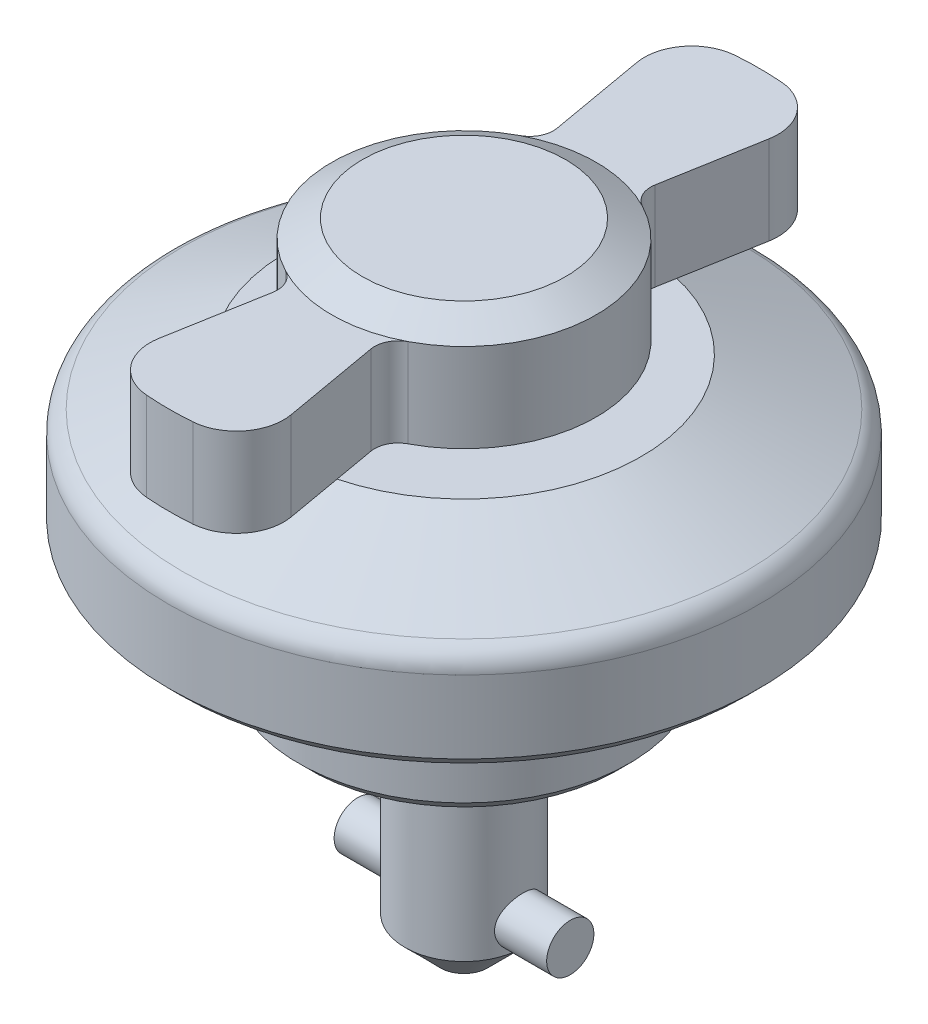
ISO-10303-21;
HEADER;
FILE_DESCRIPTION(('STEP AP214'),'2;1');
FILE_NAME('part.step','',(''),(''),'','','');
FILE_SCHEMA(('AUTOMOTIVE_DESIGN { 1 0 10303 214 1 1 1 1 }'));
ENDSEC;
DATA;
#1=APPLICATION_CONTEXT('core data for automotive mechanical design processes');
#2=APPLICATION_PROTOCOL_DEFINITION('international standard','automotive_design',2000,#1);
#3=PRODUCT_CONTEXT('',#1,'mechanical');
#4=PRODUCT('Part','Part','',(#3));
#5=PRODUCT_RELATED_PRODUCT_CATEGORY('part','',(#4));
#6=PRODUCT_DEFINITION_FORMATION('','',#4);
#7=PRODUCT_DEFINITION_CONTEXT('part definition',#1,'design');
#8=PRODUCT_DEFINITION('design','',#6,#7);
#9=PRODUCT_DEFINITION_SHAPE('','',#8);
#10=(LENGTH_UNIT() NAMED_UNIT(*) SI_UNIT(.MILLI.,.METRE.));
#11=(NAMED_UNIT(*) PLANE_ANGLE_UNIT() SI_UNIT($,.RADIAN.));
#12=(NAMED_UNIT(*) SI_UNIT($,.STERADIAN.) SOLID_ANGLE_UNIT());
#13=UNCERTAINTY_MEASURE_WITH_UNIT(LENGTH_MEASURE(1.E-05),#10,'distance_accuracy_value','');
#14=(GEOMETRIC_REPRESENTATION_CONTEXT(3) GLOBAL_UNCERTAINTY_ASSIGNED_CONTEXT((#13)) GLOBAL_UNIT_ASSIGNED_CONTEXT((#10,
#11,#12)) REPRESENTATION_CONTEXT('',''));
#15=CARTESIAN_POINT('',(0.,0.,0.));
#16=DIRECTION('',(0.,0.,1.));
#17=DIRECTION('',(1.,0.,0.));
#18=AXIS2_PLACEMENT_3D('',#15,#16,#17);
#19=CARTESIAN_POINT('',(0.,12.5,0.));
#20=DIRECTION('',(0.,1.,0.));
#21=DIRECTION('',(0.,0.,1.));
#22=AXIS2_PLACEMENT_3D('',#19,#20,#21);
#23=CYLINDRICAL_SURFACE('',#22,5.6);
#24=CARTESIAN_POINT('',(0.,16.25,0.));
#25=DIRECTION('',(0.,1.,0.));
#26=DIRECTION('',(0.,0.,1.));
#27=AXIS2_PLACEMENT_3D('',#24,#25,#26);
#28=CIRCLE('',#27,5.6);
#29=CARTESIAN_POINT('',(-2.59789595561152,16.25,4.96094110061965));
#30=VERTEX_POINT('',#29);
#31=CARTESIAN_POINT('',(-2.59789595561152,16.25,-4.96094110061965));
#32=VERTEX_POINT('',#31);
#33=EDGE_CURVE('P0_E325',#30,#32,#28,.F.);
#34=ORIENTED_EDGE('',*,*,#33,.T.);
#35=DIRECTION('',(0.,1.,0.));
#36=VECTOR('',#35,1.);
#37=CARTESIAN_POINT('',(-2.59789595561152,12.5,-4.96094110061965));
#38=LINE('',#37,#36);
#39=CARTESIAN_POINT('',(-2.59789595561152,12.5,-4.96094110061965));
#40=VERTEX_POINT('',#39);
#41=EDGE_CURVE('P0_E242',#32,#40,#38,.F.);
#42=ORIENTED_EDGE('',*,*,#41,.T.);
#43=CARTESIAN_POINT('',(0.,12.5,0.));
#44=DIRECTION('',(0.,1.,0.));
#45=DIRECTION('',(0.,0.,1.));
#46=AXIS2_PLACEMENT_3D('',#43,#44,#45);
#47=CIRCLE('',#46,5.6);
#48=CARTESIAN_POINT('',(-2.59789595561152,12.5,4.96094110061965));
#49=VERTEX_POINT('',#48);
#50=EDGE_CURVE('P0_E222',#40,#49,#47,.T.);
#51=ORIENTED_EDGE('',*,*,#50,.T.);
#52=DIRECTION('',(0.,1.,0.));
#53=VECTOR('',#52,1.);
#54=CARTESIAN_POINT('',(-2.59789595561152,12.5,4.96094110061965));
#55=LINE('',#54,#53);
#56=EDGE_CURVE('P0_E234',#49,#30,#55,.T.);
#57=ORIENTED_EDGE('',*,*,#56,.T.);
#58=EDGE_LOOP('',(#34,#42,#51,#57));
#59=FACE_BOUND('',#58,.T.);
#60=ADVANCED_FACE('P0_F16',(#59),#23,.T.);
#61=CARTESIAN_POINT('',(0.,-10.,0.));
#62=DIRECTION('',(0.,-1.,0.));
#63=DIRECTION('',(0.,0.,-1.));
#64=AXIS2_PLACEMENT_3D('',#61,#62,#63);
#65=CYLINDRICAL_SURFACE('',#64,2.);
#66=CARTESIAN_POINT('',(0.,0.,0.));
#67=DIRECTION('',(0.,-1.,0.));
#68=DIRECTION('',(0.,0.,-1.));
#69=AXIS2_PLACEMENT_3D('',#66,#67,#68);
#70=CIRCLE('',#69,2.);
#71=CARTESIAN_POINT('',(0.,0.,-2.));
#72=VERTEX_POINT('',#71);
#73=EDGE_CURVE('P0_E146',#72,#72,#70,.T.);
#74=ORIENTED_EDGE('',*,*,#73,.F.);
#75=EDGE_LOOP('',(#74));
#76=FACE_BOUND('',#75,.T.);
#77=CARTESIAN_POINT('',(0.,12.5,0.));
#78=DIRECTION('',(0.,1.,0.));
#79=DIRECTION('',(0.,0.,1.));
#80=AXIS2_PLACEMENT_3D('',#77,#78,#79);
#81=CIRCLE('',#80,2.);
#82=CARTESIAN_POINT('',(0.,12.5,2.));
#83=VERTEX_POINT('',#82);
#84=EDGE_CURVE('P0_E271',#83,#83,#81,.F.);
#85=ORIENTED_EDGE('',*,*,#84,.T.);
#86=EDGE_LOOP('',(#85));
#87=FACE_BOUND('',#86,.T.);
#88=ADVANCED_FACE('P0_F184',(#76,#87),#65,.T.);
#89=CARTESIAN_POINT('',(0.,-10.,0.));
#90=DIRECTION('',(0.,-1.,0.));
#91=DIRECTION('',(0.,0.,-1.));
#92=AXIS2_PLACEMENT_3D('',#89,#90,#91);
#93=PLANE('',#92);
#94=CARTESIAN_POINT('',(0.,-10.,0.));
#95=DIRECTION('',(0.,-1.,0.));
#96=DIRECTION('',(0.,0.,-1.));
#97=AXIS2_PLACEMENT_3D('',#94,#95,#96);
#98=CIRCLE('',#97,1.);
#99=CARTESIAN_POINT('',(0.,-10.,-1.));
#100=VERTEX_POINT('',#99);
#101=EDGE_CURVE('P0_E137',#100,#100,#98,.T.);
#102=ORIENTED_EDGE('',*,*,#101,.T.);
#103=EDGE_LOOP('',(#102));
#104=FACE_BOUND('',#103,.T.);
#105=ADVANCED_FACE('P0_F186',(#104),#93,.T.);
#106=CARTESIAN_POINT('',(0.,-10.,0.));
#107=DIRECTION('',(0.,1.,0.));
#108=DIRECTION('',(0.,0.,1.));
#109=AXIS2_PLACEMENT_3D('',#106,#107,#108);
#110=CONICAL_SURFACE('',#109,1.,0.78539816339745);
#111=CARTESIAN_POINT('',(0.,-8.50000000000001,0.));
#112=DIRECTION('',(0.,-1.,0.));
#113=DIRECTION('',(0.,0.,-1.));
#114=AXIS2_PLACEMENT_3D('',#111,#112,#113);
#115=CIRCLE('',#114,2.5);
#116=CARTESIAN_POINT('',(2.50000000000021,-8.50000000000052,0.));
#117=VERTEX_POINT('',#116);
#118=CARTESIAN_POINT('',(-2.5,-8.50000000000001,0.));
#119=VERTEX_POINT('',#118);
#120=EDGE_CURVE('P0_E129',#117,#119,#115,.T.);
#121=ORIENTED_EDGE('',*,*,#120,.T.);
#122=EDGE_CURVE('P0_E133',#119,#117,#115,.T.);
#123=ORIENTED_EDGE('',*,*,#122,.T.);
#124=EDGE_LOOP('',(#121,#123));
#125=FACE_BOUND('',#124,.T.);
#126=ORIENTED_EDGE('',*,*,#101,.F.);
#127=EDGE_LOOP('',(#126));
#128=FACE_BOUND('',#127,.T.);
#129=ADVANCED_FACE('P0_F131',(#125,#128),#110,.T.);
#130=CARTESIAN_POINT('',(0.,-10.,0.));
#131=DIRECTION('',(0.,-1.,0.));
#132=DIRECTION('',(0.,0.,-1.));
#133=AXIS2_PLACEMENT_3D('',#130,#131,#132);
#134=CYLINDRICAL_SURFACE('',#133,2.5);
#135=CARTESIAN_POINT('',(0.,0.,0.));
#136=DIRECTION('',(0.,-1.,0.));
#137=DIRECTION('',(0.,0.,-1.));
#138=AXIS2_PLACEMENT_3D('',#135,#136,#137);
#139=CIRCLE('',#138,2.5);
#140=CARTESIAN_POINT('',(0.,0.,-2.5));
#141=VERTEX_POINT('',#140);
#142=EDGE_CURVE('P0_E144',#141,#141,#139,.T.);
#143=ORIENTED_EDGE('',*,*,#142,.T.);
#144=EDGE_LOOP('',(#143));
#145=FACE_BOUND('',#144,.T.);
#146=ORIENTED_EDGE('',*,*,#120,.F.);
#147=CARTESIAN_POINT('',(2.29128784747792,-7.50000000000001,1.));
#148=CARTESIAN_POINT('',(2.29129325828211,-7.55356974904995,0.999994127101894));
#149=CARTESIAN_POINT('',(2.29319301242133,-7.60721526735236,0.995669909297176));
#150=CARTESIAN_POINT('',(2.30055457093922,-7.71296741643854,0.978534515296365));
#151=CARTESIAN_POINT('',(2.30602547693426,-7.76506975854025,0.965701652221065));
#152=CARTESIAN_POINT('',(2.31980227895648,-7.86602647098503,0.932117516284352));
#153=CARTESIAN_POINT('',(2.32809748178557,-7.91489227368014,0.911396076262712));
#154=CARTESIAN_POINT('',(2.3465733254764,-8.00844252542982,0.862710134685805));
#155=CARTESIAN_POINT('',(2.35675355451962,-8.05312788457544,0.83474721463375));
#156=CARTESIAN_POINT('',(2.37850432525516,-8.13963020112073,0.77066098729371));
#157=CARTESIAN_POINT('',(2.39011958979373,-8.18117821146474,0.734189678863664));
#158=CARTESIAN_POINT('',(2.41306228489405,-8.25776449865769,0.654854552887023));
#159=CARTESIAN_POINT('',(2.42438961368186,-8.29280050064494,0.611988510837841));
#160=CARTESIAN_POINT('',(2.44601703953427,-8.35670319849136,0.519003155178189));
#161=CARTESIAN_POINT('',(2.45625901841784,-8.38527215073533,0.468664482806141));
#162=CARTESIAN_POINT('',(2.47401963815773,-8.43342178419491,0.36341266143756));
#163=CARTESIAN_POINT('',(2.48153938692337,-8.45300612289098,0.308501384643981));
#164=CARTESIAN_POINT('',(2.49269162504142,-8.48167074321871,0.198483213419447));
#165=CARTESIAN_POINT('',(2.49649468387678,-8.49121365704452,0.143514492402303));
#166=CARTESIAN_POINT('',(2.50040155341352,-8.50101424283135,0.0326331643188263));
#167=CARTESIAN_POINT('',(2.50050674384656,-8.50127537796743,-0.0232790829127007));
#168=CARTESIAN_POINT('',(2.49710981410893,-8.49275861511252,-0.131116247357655));
#169=CARTESIAN_POINT('',(2.49380998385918,-8.48448761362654,-0.183088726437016));
#170=CARTESIAN_POINT('',(2.48424645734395,-8.46000356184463,-0.284836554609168));
#171=CARTESIAN_POINT('',(2.47798254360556,-8.44378992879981,-0.334611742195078));
#172=CARTESIAN_POINT('',(2.4629841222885,-8.40368175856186,-0.431448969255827));
#173=CARTESIAN_POINT('',(2.454213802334,-8.37967514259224,-0.478458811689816));
#174=CARTESIAN_POINT('',(2.43507292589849,-8.3247674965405,-0.567904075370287));
#175=CARTESIAN_POINT('',(2.42470182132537,-8.2938641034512,-0.610337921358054));
#176=CARTESIAN_POINT('',(2.40260818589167,-8.22367543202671,-0.692384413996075));
#177=CARTESIAN_POINT('',(2.3908416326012,-8.18397305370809,-0.73162892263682));
#178=CARTESIAN_POINT('',(2.36780830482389,-8.09850471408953,-0.803053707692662));
#179=CARTESIAN_POINT('',(2.35654169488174,-8.05273677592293,-0.835231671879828));
#180=CARTESIAN_POINT('',(2.33548448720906,-7.95479048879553,-0.892452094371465));
#181=CARTESIAN_POINT('',(2.3257445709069,-7.9024675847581,-0.917267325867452));
#182=CARTESIAN_POINT('',(2.30943795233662,-7.793892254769,-0.957588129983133));
#183=CARTESIAN_POINT('',(2.3028691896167,-7.73764240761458,-0.973099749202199));
#184=CARTESIAN_POINT('',(2.29414879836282,-7.62648211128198,-0.993477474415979));
#185=CARTESIAN_POINT('',(2.29175183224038,-7.57169977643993,-0.998936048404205));
#186=CARTESIAN_POINT('',(2.29094748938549,-7.46196139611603,-1.00078066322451));
#187=CARTESIAN_POINT('',(2.29253890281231,-7.40700540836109,-0.997169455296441));
#188=CARTESIAN_POINT('',(2.29928022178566,-7.30177053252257,-0.981516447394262));
#189=CARTESIAN_POINT('',(2.30422228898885,-7.25140353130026,-0.969966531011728));
#190=CARTESIAN_POINT('',(2.31685025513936,-7.153355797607,-0.939402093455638));
#191=CARTESIAN_POINT('',(2.32453676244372,-7.10567566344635,-0.920385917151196));
#192=CARTESIAN_POINT('',(2.34216890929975,-7.01219882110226,-0.874567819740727));
#193=CARTESIAN_POINT('',(2.35219352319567,-6.96655690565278,-0.847481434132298));
#194=CARTESIAN_POINT('',(2.37325192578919,-6.88025850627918,-0.786582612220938));
#195=CARTESIAN_POINT('',(2.38428612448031,-6.83960406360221,-0.752767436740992));
#196=CARTESIAN_POINT('',(2.40710457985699,-6.7613132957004,-0.676422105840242));
#197=CARTESIAN_POINT('',(2.41888403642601,-6.72412171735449,-0.63343271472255));
#198=CARTESIAN_POINT('',(2.44109897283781,-6.65741146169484,-0.541541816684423));
#199=CARTESIAN_POINT('',(2.4515343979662,-6.62789309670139,-0.492640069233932));
#200=CARTESIAN_POINT('',(2.46991857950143,-6.57747618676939,-0.390139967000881));
#201=CARTESIAN_POINT('',(2.47786793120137,-6.55657557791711,-0.336542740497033));
#202=CARTESIAN_POINT('',(2.49036356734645,-6.52422557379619,-0.226196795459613));
#203=CARTESIAN_POINT('',(2.49491169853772,-6.51277104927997,-0.169449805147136));
#204=CARTESIAN_POINT('',(2.49989504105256,-6.50024764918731,-0.0584082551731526));
#205=CARTESIAN_POINT('',(2.50057923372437,-6.49854993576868,-0.00419524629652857));
#206=CARTESIAN_POINT('',(2.49843021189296,-6.50392773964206,0.103716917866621));
#207=CARTESIAN_POINT('',(2.49559752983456,-6.51100192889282,0.15741614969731));
#208=CARTESIAN_POINT('',(2.48685756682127,-6.53327339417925,0.261085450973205));
#209=CARTESIAN_POINT('',(2.48104740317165,-6.54821447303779,0.311119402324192));
#210=CARTESIAN_POINT('',(2.46697473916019,-6.58552640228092,0.407961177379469));
#211=CARTESIAN_POINT('',(2.45871178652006,-6.60789862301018,0.454768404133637));
#212=CARTESIAN_POINT('',(2.44009047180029,-6.66055159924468,0.546101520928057));
#213=CARTESIAN_POINT('',(2.42965564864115,-6.69113814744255,0.590435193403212));
#214=CARTESIAN_POINT('',(2.40794701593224,-6.75889425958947,0.673527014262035));
#215=CARTESIAN_POINT('',(2.3966728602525,-6.79606654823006,0.712282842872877));
#216=CARTESIAN_POINT('',(2.37368881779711,-6.87865761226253,0.785600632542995));
#217=CARTESIAN_POINT('',(2.36199516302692,-6.92444443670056,0.819754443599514));
#218=CARTESIAN_POINT('',(2.3402483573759,-7.02147106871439,0.879923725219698));
#219=CARTESIAN_POINT('',(2.33019539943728,-7.07271151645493,0.905938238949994));
#220=CARTESIAN_POINT('',(2.31379432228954,-7.17451860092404,0.946995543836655));
#221=CARTESIAN_POINT('',(2.30719459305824,-7.22473261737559,0.962813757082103));
#222=CARTESIAN_POINT('',(2.29723001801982,-7.32724270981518,0.986358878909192));
#223=CARTESIAN_POINT('',(2.29385616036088,-7.37953255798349,0.994108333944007));
#224=CARTESIAN_POINT('',(2.29162229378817,-7.45468878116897,0.999232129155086));
#225=CARTESIAN_POINT('',(2.29128555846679,-7.47733761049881,1.00000248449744));
#226=CARTESIAN_POINT('',(2.29128784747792,-7.50000000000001,1.));
#227=B_SPLINE_CURVE_WITH_KNOTS('',3,(#147,#148,#149,#150,#151,#152,#153,#154,#155,#156,#157,
#158,#159,#160,#161,#162,#163,#164,#165,#166,#167,#168,#169,#170,#171,#172,#173,#174,#175,#176,
#177,#178,#179,#180,#181,#182,#183,#184,#185,#186,#187,#188,#189,#190,#191,#192,#193,#194,#195,
#196,#197,#198,#199,#200,#201,#202,#203,#204,#205,#206,#207,#208,#209,#210,#211,#212,#213,#214,
#215,#216,#217,#218,#219,#220,#221,#222,#223,#224,#225,#226),.UNSPECIFIED.,.T.,.F.,(4,2,2,2,2,2,
2,2,2,2,2,2,2,2,2,2,2,2,2,2,2,2,2,2,2,2,2,2,2,2,2,2,2,2,2,2,2,2,2,4),(0.,0.160638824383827,
0.321688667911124,0.482135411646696,0.642547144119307,0.811278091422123,0.980067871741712,
1.15551334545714,1.3308873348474,1.49777091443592,1.66459222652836,1.82204322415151,
1.9795057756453,2.13934150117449,2.29923207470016,2.46962022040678,2.64006403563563,
2.81532229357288,2.99046652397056,3.15491073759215,3.31930507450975,3.47433624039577,
3.62940179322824,3.79075577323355,3.95217557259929,4.12551867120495,4.29886882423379,
4.47217743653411,4.64539187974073,4.80730519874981,4.96919400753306,5.12610997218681,
5.28305488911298,5.44693525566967,5.61088358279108,5.78498126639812,5.95909940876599,
6.11758330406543,6.27562315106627,6.34358052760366),.UNSPECIFIED.);
#228=EDGE_CURVE('P0_E143',#117,#117,#227,.T.);
#229=ORIENTED_EDGE('',*,*,#228,.F.);
#230=ORIENTED_EDGE('',*,*,#122,.F.);
#231=CARTESIAN_POINT('',(-2.29128784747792,-7.50000000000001,1.));
#232=CARTESIAN_POINT('',(-2.29129325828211,-7.44643025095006,0.999994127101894));
#233=CARTESIAN_POINT('',(-2.29319301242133,-7.39278473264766,0.995669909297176));
#234=CARTESIAN_POINT('',(-2.30055457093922,-7.28703258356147,0.978534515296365));
#235=CARTESIAN_POINT('',(-2.30602547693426,-7.23493024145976,0.965701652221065));
#236=CARTESIAN_POINT('',(-2.31980227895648,-7.13397352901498,0.932117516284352));
#237=CARTESIAN_POINT('',(-2.32809748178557,-7.08510772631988,0.911396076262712));
#238=CARTESIAN_POINT('',(-2.3465733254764,-6.9915574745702,0.862710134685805));
#239=CARTESIAN_POINT('',(-2.35675355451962,-6.94687211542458,0.83474721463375));
#240=CARTESIAN_POINT('',(-2.37850432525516,-6.86036979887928,0.77066098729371));
#241=CARTESIAN_POINT('',(-2.39011958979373,-6.81882178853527,0.734189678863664));
#242=CARTESIAN_POINT('',(-2.41306228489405,-6.74223550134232,0.654854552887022));
#243=CARTESIAN_POINT('',(-2.42438961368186,-6.70719949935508,0.61198851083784));
#244=CARTESIAN_POINT('',(-2.44601703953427,-6.64329680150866,0.519003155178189));
#245=CARTESIAN_POINT('',(-2.45625901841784,-6.61472784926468,0.468664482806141));
#246=CARTESIAN_POINT('',(-2.47401963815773,-6.5665782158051,0.36341266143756));
#247=CARTESIAN_POINT('',(-2.48153938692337,-6.54699387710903,0.308501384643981));
#248=CARTESIAN_POINT('',(-2.49269162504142,-6.51832925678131,0.198483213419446));
#249=CARTESIAN_POINT('',(-2.49649468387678,-6.5087863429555,0.143514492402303));
#250=CARTESIAN_POINT('',(-2.50040155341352,-6.49898575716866,0.0326331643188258));
#251=CARTESIAN_POINT('',(-2.50050674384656,-6.49872462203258,-0.0232790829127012));
#252=CARTESIAN_POINT('',(-2.49710981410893,-6.5072413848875,-0.131116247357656));
#253=CARTESIAN_POINT('',(-2.49380998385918,-6.51551238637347,-0.183088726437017));
#254=CARTESIAN_POINT('',(-2.48424645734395,-6.53999643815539,-0.284836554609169));
#255=CARTESIAN_POINT('',(-2.47798254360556,-6.5562100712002,-0.334611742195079));
#256=CARTESIAN_POINT('',(-2.4629841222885,-6.59631824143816,-0.431448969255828));
#257=CARTESIAN_POINT('',(-2.454213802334,-6.62032485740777,-0.478458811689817));
#258=CARTESIAN_POINT('',(-2.43507292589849,-6.67523250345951,-0.567904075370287));
#259=CARTESIAN_POINT('',(-2.42470182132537,-6.70613589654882,-0.610337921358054));
#260=CARTESIAN_POINT('',(-2.40260818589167,-6.7763245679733,-0.692384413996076));
#261=CARTESIAN_POINT('',(-2.3908416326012,-6.81602694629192,-0.731628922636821));
#262=CARTESIAN_POINT('',(-2.36780830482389,-6.90149528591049,-0.803053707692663));
#263=CARTESIAN_POINT('',(-2.35654169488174,-6.94726322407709,-0.835231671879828));
#264=CARTESIAN_POINT('',(-2.33548448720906,-7.04520951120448,-0.892452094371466));
#265=CARTESIAN_POINT('',(-2.3257445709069,-7.09753241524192,-0.917267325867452));
#266=CARTESIAN_POINT('',(-2.30943795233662,-7.20610774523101,-0.957588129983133));
#267=CARTESIAN_POINT('',(-2.3028691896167,-7.26235759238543,-0.973099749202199));
#268=CARTESIAN_POINT('',(-2.29414879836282,-7.37351788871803,-0.993477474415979));
#269=CARTESIAN_POINT('',(-2.29175183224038,-7.42830022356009,-0.998936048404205));
#270=CARTESIAN_POINT('',(-2.29094748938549,-7.53803860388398,-1.00078066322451));
#271=CARTESIAN_POINT('',(-2.29253890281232,-7.59299459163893,-0.997169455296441));
#272=CARTESIAN_POINT('',(-2.29928022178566,-7.69822946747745,-0.981516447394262));
#273=CARTESIAN_POINT('',(-2.30422228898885,-7.74859646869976,-0.969966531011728));
#274=CARTESIAN_POINT('',(-2.31685025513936,-7.84664420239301,-0.939402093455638));
#275=CARTESIAN_POINT('',(-2.32453676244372,-7.89432433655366,-0.920385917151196));
#276=CARTESIAN_POINT('',(-2.34216890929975,-7.98780117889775,-0.874567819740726));
#277=CARTESIAN_POINT('',(-2.35219352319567,-8.03344309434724,-0.847481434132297));
#278=CARTESIAN_POINT('',(-2.37325192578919,-8.11974149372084,-0.786582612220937));
#279=CARTESIAN_POINT('',(-2.38428612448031,-8.1603959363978,-0.752767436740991));
#280=CARTESIAN_POINT('',(-2.40710457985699,-8.23868670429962,-0.676422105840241));
#281=CARTESIAN_POINT('',(-2.41888403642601,-8.27587828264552,-0.633432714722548));
#282=CARTESIAN_POINT('',(-2.44109897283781,-8.34258853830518,-0.54154181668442));
#283=CARTESIAN_POINT('',(-2.4515343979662,-8.37210690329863,-0.492640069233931));
#284=CARTESIAN_POINT('',(-2.46991857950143,-8.42252381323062,-0.39013996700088));
#285=CARTESIAN_POINT('',(-2.47786793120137,-8.4434244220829,-0.336542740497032));
#286=CARTESIAN_POINT('',(-2.49036356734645,-8.47577442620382,-0.226196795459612));
#287=CARTESIAN_POINT('',(-2.49491169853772,-8.48722895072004,-0.169449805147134));
#288=CARTESIAN_POINT('',(-2.49989504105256,-8.4997523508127,-0.0584082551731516));
#289=CARTESIAN_POINT('',(-2.50057923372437,-8.50145006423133,-0.00419524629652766));
#290=CARTESIAN_POINT('',(-2.49843021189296,-8.49607226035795,0.103716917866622));
#291=CARTESIAN_POINT('',(-2.49559752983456,-8.4889980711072,0.157416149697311));
#292=CARTESIAN_POINT('',(-2.48685756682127,-8.46672660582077,0.261085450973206));
#293=CARTESIAN_POINT('',(-2.48104740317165,-8.45178552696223,0.311119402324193));
#294=CARTESIAN_POINT('',(-2.46697473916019,-8.41447359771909,0.40796117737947));
#295=CARTESIAN_POINT('',(-2.45871178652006,-8.39210137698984,0.454768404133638));
#296=CARTESIAN_POINT('',(-2.44009047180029,-8.33944840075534,0.546101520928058));
#297=CARTESIAN_POINT('',(-2.42965564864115,-8.30886185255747,0.590435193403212));
#298=CARTESIAN_POINT('',(-2.40794701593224,-8.24110574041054,0.673527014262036));
#299=CARTESIAN_POINT('',(-2.3966728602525,-8.20393345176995,0.712282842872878));
#300=CARTESIAN_POINT('',(-2.37368881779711,-8.12134238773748,0.785600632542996));
#301=CARTESIAN_POINT('',(-2.36199516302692,-8.07555556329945,0.819754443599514));
#302=CARTESIAN_POINT('',(-2.3402483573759,-7.97852893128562,0.879923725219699));
#303=CARTESIAN_POINT('',(-2.33019539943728,-7.92728848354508,0.905938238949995));
#304=CARTESIAN_POINT('',(-2.31379432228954,-7.82548139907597,0.946995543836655));
#305=CARTESIAN_POINT('',(-2.30719459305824,-7.77526738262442,0.962813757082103));
#306=CARTESIAN_POINT('',(-2.29723001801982,-7.67275729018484,0.986358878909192));
#307=CARTESIAN_POINT('',(-2.29385616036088,-7.62046744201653,0.994108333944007));
#308=CARTESIAN_POINT('',(-2.29162229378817,-7.54531121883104,0.999232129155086));
#309=CARTESIAN_POINT('',(-2.29128555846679,-7.52266238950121,1.00000248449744));
#310=CARTESIAN_POINT('',(-2.29128784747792,-7.50000000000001,1.));
#311=B_SPLINE_CURVE_WITH_KNOTS('',3,(#231,#232,#233,#234,#235,#236,#237,#238,#239,#240,#241,
#242,#243,#244,#245,#246,#247,#248,#249,#250,#251,#252,#253,#254,#255,#256,#257,#258,#259,#260,
#261,#262,#263,#264,#265,#266,#267,#268,#269,#270,#271,#272,#273,#274,#275,#276,#277,#278,#279,
#280,#281,#282,#283,#284,#285,#286,#287,#288,#289,#290,#291,#292,#293,#294,#295,#296,#297,#298,
#299,#300,#301,#302,#303,#304,#305,#306,#307,#308,#309,#310),.UNSPECIFIED.,.T.,.F.,(4,2,2,2,2,2,
2,2,2,2,2,2,2,2,2,2,2,2,2,2,2,2,2,2,2,2,2,2,2,2,2,2,2,2,2,2,2,2,2,4),(0.,0.160638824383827,
0.321688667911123,0.482135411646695,0.642547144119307,0.811278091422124,0.980067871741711,
1.15551334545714,1.3308873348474,1.49777091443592,1.66459222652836,1.82204322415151,
1.9795057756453,2.13934150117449,2.29923207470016,2.46962022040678,2.64006403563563,
2.81532229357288,2.99046652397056,3.15491073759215,3.31930507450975,3.47433624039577,
3.62940179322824,3.79075577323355,3.9521755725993,4.12551867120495,4.29886882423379,
4.47217743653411,4.64539187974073,4.80730519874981,4.96919400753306,5.12610997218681,
5.28305488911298,5.44693525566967,5.61088358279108,5.78498126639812,5.95909940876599,
6.11758330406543,6.27562315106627,6.34358052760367),.UNSPECIFIED.);
#312=EDGE_CURVE('P0_E141',#119,#119,#311,.T.);
#313=ORIENTED_EDGE('',*,*,#312,.F.);
#314=EDGE_LOOP('',(#146,#229,#230,#313));
#315=FACE_BOUND('',#314,.T.);
#316=ADVANCED_FACE('P0_F139',(#145,#315),#134,.T.);
#317=CARTESIAN_POINT('',(2.5,0.,0.));
#318=DIRECTION('',(0.,1.,0.));
#319=DIRECTION('',(0.,0.,1.));
#320=AXIS2_PLACEMENT_3D('',#317,#318,#319);
#321=PLANE('',#320);
#322=ORIENTED_EDGE('',*,*,#73,.T.);
#323=EDGE_LOOP('',(#322));
#324=FACE_BOUND('',#323,.T.);
#325=ORIENTED_EDGE('',*,*,#142,.F.);
#326=EDGE_LOOP('',(#325));
#327=FACE_BOUND('',#326,.T.);
#328=ADVANCED_FACE('P0_F176',(#324,#327),#321,.T.);
#329=CARTESIAN_POINT('',(-4.5,-7.50000000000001,0.));
#330=DIRECTION('',(-1.,0.,0.));
#331=DIRECTION('',(0.,0.,1.));
#332=AXIS2_PLACEMENT_3D('',#329,#330,#331);
#333=PLANE('',#332);
#334=CARTESIAN_POINT('',(-4.5,-7.50000000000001,0.));
#335=DIRECTION('',(-1.,0.,0.));
#336=DIRECTION('',(0.,0.,1.));
#337=AXIS2_PLACEMENT_3D('',#334,#335,#336);
#338=CIRCLE('',#337,1.);
#339=CARTESIAN_POINT('',(-4.5,-7.50000000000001,1.));
#340=VERTEX_POINT('',#339);
#341=EDGE_CURVE('P0_E315',#340,#340,#338,.T.);
#342=ORIENTED_EDGE('',*,*,#341,.T.);
#343=EDGE_LOOP('',(#342));
#344=FACE_BOUND('',#343,.T.);
#345=ADVANCED_FACE('P0_F169',(#344),#333,.T.);
#346=CARTESIAN_POINT('',(-5.26029262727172,-7.50000000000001,0.));
#347=DIRECTION('',(-1.,0.,0.));
#348=DIRECTION('',(0.,0.,1.));
#349=AXIS2_PLACEMENT_3D('',#346,#347,#348);
#350=CYLINDRICAL_SURFACE('',#349,1.);
#351=ORIENTED_EDGE('',*,*,#312,.T.);
#352=EDGE_LOOP('',(#351));
#353=FACE_BOUND('',#352,.T.);
#354=ORIENTED_EDGE('',*,*,#341,.F.);
#355=EDGE_LOOP('',(#354));
#356=FACE_BOUND('',#355,.T.);
#357=ADVANCED_FACE('P0_F163',(#353,#356),#350,.T.);
#358=ORIENTED_EDGE('',*,*,#228,.T.);
#359=EDGE_LOOP('',(#358));
#360=FACE_BOUND('',#359,.T.);
#361=CARTESIAN_POINT('',(4.5,-7.50000000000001,0.));
#362=DIRECTION('',(-1.,0.,0.));
#363=DIRECTION('',(0.,0.,1.));
#364=AXIS2_PLACEMENT_3D('',#361,#362,#363);
#365=CIRCLE('',#364,1.);
#366=CARTESIAN_POINT('',(4.5,-7.50000000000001,1.));
#367=VERTEX_POINT('',#366);
#368=EDGE_CURVE('P0_E312',#367,#367,#365,.T.);
#369=ORIENTED_EDGE('',*,*,#368,.T.);
#370=EDGE_LOOP('',(#369));
#371=FACE_BOUND('',#370,.T.);
#372=ADVANCED_FACE('P0_F168',(#360,#371),#350,.T.);
#373=CARTESIAN_POINT('',(4.5,-8.50000000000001,0.));
#374=DIRECTION('',(1.,0.,0.));
#375=DIRECTION('',(0.,0.,-1.));
#376=AXIS2_PLACEMENT_3D('',#373,#374,#375);
#377=PLANE('',#376);
#378=ORIENTED_EDGE('',*,*,#368,.F.);
#379=EDGE_LOOP('',(#378));
#380=FACE_BOUND('',#379,.T.);
#381=ADVANCED_FACE('P0_F171',(#380),#377,.T.);
#382=CARTESIAN_POINT('',(2.59789595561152,12.5,4.96094110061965));
#383=VERTEX_POINT('',#382);
#384=CARTESIAN_POINT('',(2.59789595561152,12.5,-4.96094110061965));
#385=VERTEX_POINT('',#384);
#386=EDGE_CURVE('P0_E215',#383,#385,#47,.T.);
#387=ORIENTED_EDGE('',*,*,#386,.T.);
#388=DIRECTION('',(0.,1.,0.));
#389=VECTOR('',#388,1.);
#390=CARTESIAN_POINT('',(2.59789595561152,12.5,-4.96094110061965));
#391=LINE('',#390,#389);
#392=CARTESIAN_POINT('',(2.59789595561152,16.25,-4.96094110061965));
#393=VERTEX_POINT('',#392);
#394=EDGE_CURVE('P0_E218',#385,#393,#391,.T.);
#395=ORIENTED_EDGE('',*,*,#394,.T.);
#396=CARTESIAN_POINT('',(2.59789595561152,16.25,4.96094110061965));
#397=VERTEX_POINT('',#396);
#398=EDGE_CURVE('P0_E328',#393,#397,#28,.F.);
#399=ORIENTED_EDGE('',*,*,#398,.T.);
#400=DIRECTION('',(0.,1.,0.));
#401=VECTOR('',#400,1.);
#402=CARTESIAN_POINT('',(2.59789595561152,12.5,4.96094110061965));
#403=LINE('',#402,#401);
#404=EDGE_CURVE('P0_E220',#397,#383,#403,.F.);
#405=ORIENTED_EDGE('',*,*,#404,.T.);
#406=EDGE_LOOP('',(#387,#395,#399,#405));
#407=FACE_BOUND('',#406,.T.);
#408=ADVANCED_FACE('P0_F199',(#407),#23,.T.);
#409=CARTESIAN_POINT('',(0.,12.5,0.));
#410=DIRECTION('',(0.,1.,0.));
#411=DIRECTION('',(0.,0.,1.));
#412=AXIS2_PLACEMENT_3D('',#409,#410,#411);
#413=PLANE('',#412);
#414=ORIENTED_EDGE('',*,*,#84,.F.);
#415=EDGE_LOOP('',(#414));
#416=FACE_BOUND('',#415,.T.);
#417=CARTESIAN_POINT('',(0.,12.5,0.));
#418=DIRECTION('',(0.,-1.,0.));
#419=DIRECTION('',(0.,0.,-1.));
#420=AXIS2_PLACEMENT_3D('',#417,#418,#419);
#421=CIRCLE('',#420,12.5);
#422=CARTESIAN_POINT('',(-0.988345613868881,12.5,-12.460865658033));
#423=VERTEX_POINT('',#422);
#424=CARTESIAN_POINT('',(0.988345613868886,12.5,-12.460865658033));
#425=VERTEX_POINT('',#424);
#426=EDGE_CURVE('P0_E309',#423,#425,#421,.T.);
#427=ORIENTED_EDGE('',*,*,#426,.T.);
#428=CARTESIAN_POINT('',(0.830210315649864,12.5,-10.4671271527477));
#429=DIRECTION('',(0.,1.,0.));
#430=DIRECTION('',(0.,0.,1.));
#431=AXIS2_PLACEMENT_3D('',#428,#429,#430);
#432=CIRCLE('',#431,2.);
#433=CARTESIAN_POINT('',(2.79982582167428,12.5,-10.1198307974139));
#434=VERTEX_POINT('',#433);
#435=EDGE_CURVE('P0_E339',#425,#434,#432,.F.);
#436=ORIENTED_EDGE('',*,*,#435,.T.);
#437=DIRECTION('',(0.173648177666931,0.,-0.984807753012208));
#438=VECTOR('',#437,1.);
#439=CARTESIAN_POINT('',(4.65281599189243,12.5,-20.6286602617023));
#440=LINE('',#439,#438);
#441=CARTESIAN_POINT('',(2.07699819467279,12.5,-6.02047161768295));
#442=VERTEX_POINT('',#441);
#443=EDGE_CURVE('P0_E304',#442,#434,#440,.T.);
#444=ORIENTED_EDGE('',*,*,#443,.F.);
#445=CARTESIAN_POINT('',(3.061805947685,12.5,-5.84682344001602));
#446=DIRECTION('',(0.,1.,0.));
#447=DIRECTION('',(0.,0.,1.));
#448=AXIS2_PLACEMENT_3D('',#445,#446,#447);
#449=CIRCLE('',#448,1.);
#450=EDGE_CURVE('P0_E229',#442,#385,#449,.T.);
#451=ORIENTED_EDGE('',*,*,#450,.T.);
#452=ORIENTED_EDGE('',*,*,#386,.F.);
#453=CARTESIAN_POINT('',(3.061805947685,12.5,5.84682344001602));
#454=DIRECTION('',(0.,1.,0.));
#455=DIRECTION('',(0.,0.,1.));
#456=AXIS2_PLACEMENT_3D('',#453,#454,#455);
#457=CIRCLE('',#456,1.);
#458=CARTESIAN_POINT('',(2.0769981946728,12.5,6.02047161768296));
#459=VERTEX_POINT('',#458);
#460=EDGE_CURVE('P0_E252',#383,#459,#457,.T.);
#461=ORIENTED_EDGE('',*,*,#460,.T.);
#462=DIRECTION('',(0.173648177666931,0.,0.984807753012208));
#463=VECTOR('',#462,1.);
#464=CARTESIAN_POINT('',(-2.68320048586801,12.5,-20.9759566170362));
#465=LINE('',#464,#463);
#466=CARTESIAN_POINT('',(2.79982582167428,12.5,10.1198307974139));
#467=VERTEX_POINT('',#466);
#468=EDGE_CURVE('P0_E295',#459,#467,#465,.T.);
#469=ORIENTED_EDGE('',*,*,#468,.T.);
#470=CARTESIAN_POINT('',(0.830210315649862,12.5,10.4671271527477));
#471=DIRECTION('',(0.,1.,0.));
#472=DIRECTION('',(0.,0.,1.));
#473=AXIS2_PLACEMENT_3D('',#470,#471,#472);
#474=CIRCLE('',#473,2.);
#475=CARTESIAN_POINT('',(0.988345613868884,12.5,12.460865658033));
#476=VERTEX_POINT('',#475);
#477=EDGE_CURVE('P0_E337',#467,#476,#474,.F.);
#478=ORIENTED_EDGE('',*,*,#477,.T.);
#479=CARTESIAN_POINT('',(0.,12.5,0.));
#480=DIRECTION('',(0.,-1.,0.));
#481=DIRECTION('',(0.,0.,-1.));
#482=AXIS2_PLACEMENT_3D('',#479,#480,#481);
#483=CIRCLE('',#482,12.5);
#484=CARTESIAN_POINT('',(-0.988345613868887,12.5,12.460865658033));
#485=VERTEX_POINT('',#484);
#486=EDGE_CURVE('P0_E297',#476,#485,#483,.T.);
#487=ORIENTED_EDGE('',*,*,#486,.T.);
#488=CARTESIAN_POINT('',(-0.830210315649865,12.5,10.4671271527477));
#489=DIRECTION('',(0.,1.,0.));
#490=DIRECTION('',(0.,0.,1.));
#491=AXIS2_PLACEMENT_3D('',#488,#489,#490);
#492=CIRCLE('',#491,2.);
#493=CARTESIAN_POINT('',(-2.79982582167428,12.5,10.1198307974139));
#494=VERTEX_POINT('',#493);
#495=EDGE_CURVE('P0_E335',#485,#494,#492,.F.);
#496=ORIENTED_EDGE('',*,*,#495,.T.);
#497=DIRECTION('',(-0.173648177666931,0.,0.984807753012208));
#498=VECTOR('',#497,1.);
#499=CARTESIAN_POINT('',(2.68320048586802,12.5,-20.9759566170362));
#500=LINE('',#499,#498);
#501=CARTESIAN_POINT('',(-2.0769981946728,12.5,6.02047161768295));
#502=VERTEX_POINT('',#501);
#503=EDGE_CURVE('P0_E266',#502,#494,#500,.T.);
#504=ORIENTED_EDGE('',*,*,#503,.F.);
#505=CARTESIAN_POINT('',(-3.061805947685,12.5,5.84682344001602));
#506=DIRECTION('',(0.,1.,0.));
#507=DIRECTION('',(0.,0.,1.));
#508=AXIS2_PLACEMENT_3D('',#505,#506,#507);
#509=CIRCLE('',#508,1.);
#510=EDGE_CURVE('P0_E25',#502,#49,#509,.T.);
#511=ORIENTED_EDGE('',*,*,#510,.T.);
#512=ORIENTED_EDGE('',*,*,#50,.F.);
#513=CARTESIAN_POINT('',(-3.061805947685,12.5,-5.84682344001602));
#514=DIRECTION('',(0.,1.,0.));
#515=DIRECTION('',(0.,0.,1.));
#516=AXIS2_PLACEMENT_3D('',#513,#514,#515);
#517=CIRCLE('',#516,1.);
#518=CARTESIAN_POINT('',(-2.07699819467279,12.5,-6.02047161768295));
#519=VERTEX_POINT('',#518);
#520=EDGE_CURVE('P0_E257',#40,#519,#517,.T.);
#521=ORIENTED_EDGE('',*,*,#520,.T.);
#522=DIRECTION('',(-0.173648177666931,0.,-0.984807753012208));
#523=VECTOR('',#522,1.);
#524=CARTESIAN_POINT('',(-4.65281599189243,12.5,-20.6286602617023));
#525=LINE('',#524,#523);
#526=CARTESIAN_POINT('',(-2.79982582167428,12.5,-10.1198307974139));
#527=VERTEX_POINT('',#526);
#528=EDGE_CURVE('P0_E288',#519,#527,#525,.T.);
#529=ORIENTED_EDGE('',*,*,#528,.T.);
#530=CARTESIAN_POINT('',(-0.83021031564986,12.5,-10.4671271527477));
#531=DIRECTION('',(0.,1.,0.));
#532=DIRECTION('',(0.,0.,1.));
#533=AXIS2_PLACEMENT_3D('',#530,#531,#532);
#534=CIRCLE('',#533,2.);
#535=EDGE_CURVE('P0_E333',#527,#423,#534,.F.);
#536=ORIENTED_EDGE('',*,*,#535,.T.);
#537=EDGE_LOOP('',(#427,#436,#444,#451,#452,#461,#469,#478,#487,#496,#504,#511,#512,#521,#529,#536));
#538=FACE_BOUND('',#537,.T.);
#539=ADVANCED_FACE('P0_F182',(#416,#538),#413,.F.);
#540=CARTESIAN_POINT('',(1.5,17.,0.));
#541=DIRECTION('',(0.,1.,0.));
#542=DIRECTION('',(0.,0.,1.));
#543=AXIS2_PLACEMENT_3D('',#540,#541,#542);
#544=PLANE('',#543);
#545=CARTESIAN_POINT('',(0.,17.,0.));
#546=DIRECTION('',(0.,1.,0.));
#547=DIRECTION('',(0.,0.,1.));
#548=AXIS2_PLACEMENT_3D('',#545,#546,#547);
#549=CIRCLE('',#548,4.30096189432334);
#550=CARTESIAN_POINT('',(0.,17.,4.30096189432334));
#551=VERTEX_POINT('',#550);
#552=EDGE_CURVE('P0_E322',#551,#551,#549,.T.);
#553=ORIENTED_EDGE('',*,*,#552,.T.);
#554=EDGE_LOOP('',(#553));
#555=FACE_BOUND('',#554,.T.);
#556=ADVANCED_FACE('P0_F178',(#555),#544,.T.);
#557=CARTESIAN_POINT('',(0.,17.,0.));
#558=DIRECTION('',(0.,-1.,0.));
#559=DIRECTION('',(0.,0.,-1.));
#560=AXIS2_PLACEMENT_3D('',#557,#558,#559);
#561=CONICAL_SURFACE('',#560,4.30096189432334,1.0471975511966);
#562=EDGE_CURVE('P0_E32',#32,#393,#28,.F.);
#563=ORIENTED_EDGE('',*,*,#562,.F.);
#564=ORIENTED_EDGE('',*,*,#33,.F.);
#565=CARTESIAN_POINT('',(0.,16.25,0.));
#566=DIRECTION('',(0.,-1.,0.));
#567=DIRECTION('',(0.,0.,-1.));
#568=AXIS2_PLACEMENT_3D('',#565,#566,#567);
#569=CIRCLE('',#568,5.6);
#570=EDGE_CURVE('P0_E280',#397,#30,#569,.T.);
#571=ORIENTED_EDGE('',*,*,#570,.F.);
#572=ORIENTED_EDGE('',*,*,#398,.F.);
#573=EDGE_LOOP('',(#563,#564,#571,#572));
#574=FACE_BOUND('',#573,.T.);
#575=ORIENTED_EDGE('',*,*,#552,.F.);
#576=EDGE_LOOP('',(#575));
#577=FACE_BOUND('',#576,.T.);
#578=ADVANCED_FACE('P0_F181',(#574,#577),#561,.T.);
#579=CARTESIAN_POINT('',(-4.65281599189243,16.25,-20.6286602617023));
#580=DIRECTION('',(-0.984807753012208,0.,0.173648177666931));
#581=DIRECTION('',(0.173648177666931,0.,0.984807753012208));
#582=AXIS2_PLACEMENT_3D('',#579,#580,#581);
#583=PLANE('',#582);
#584=ORIENTED_EDGE('',*,*,#528,.F.);
#585=DIRECTION('',(0.,-1.,0.));
#586=VECTOR('',#585,1.);
#587=CARTESIAN_POINT('',(-2.07699819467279,16.25,-6.02047161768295));
#588=LINE('',#587,#586);
#589=CARTESIAN_POINT('',(-2.07699819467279,16.25,-6.02047161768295));
#590=VERTEX_POINT('',#589);
#591=EDGE_CURVE('P0_E245',#519,#590,#588,.F.);
#592=ORIENTED_EDGE('',*,*,#591,.T.);
#593=DIRECTION('',(-0.173648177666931,0.,-0.984807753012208));
#594=VECTOR('',#593,1.);
#595=CARTESIAN_POINT('',(-4.65281599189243,16.25,-20.6286602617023));
#596=LINE('',#595,#594);
#597=CARTESIAN_POINT('',(-2.79982582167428,16.25,-10.1198307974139));
#598=VERTEX_POINT('',#597);
#599=EDGE_CURVE('P0_E301',#590,#598,#596,.T.);
#600=ORIENTED_EDGE('',*,*,#599,.T.);
#601=DIRECTION('',(0.,-1.,0.));
#602=VECTOR('',#601,1.);
#603=CARTESIAN_POINT('',(-2.79982582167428,16.25,-10.1198307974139));
#604=LINE('',#603,#602);
#605=EDGE_CURVE('P0_E364',#598,#527,#604,.T.);
#606=ORIENTED_EDGE('',*,*,#605,.T.);
#607=EDGE_LOOP('',(#584,#592,#600,#606));
#608=FACE_BOUND('',#607,.T.);
#609=ADVANCED_FACE('P0_F394',(#608),#583,.T.);
#610=CARTESIAN_POINT('',(4.65281599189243,16.25,-20.6286602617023));
#611=DIRECTION('',(-0.984807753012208,0.,-0.173648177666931));
#612=DIRECTION('',(-0.173648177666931,0.,0.984807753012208));
#613=AXIS2_PLACEMENT_3D('',#610,#611,#612);
#614=PLANE('',#613);
#615=DIRECTION('',(0.173648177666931,0.,-0.984807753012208));
#616=VECTOR('',#615,1.);
#617=CARTESIAN_POINT('',(4.65281599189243,16.25,-20.6286602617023));
#618=LINE('',#617,#616);
#619=CARTESIAN_POINT('',(2.07699819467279,16.25,-6.02047161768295));
#620=VERTEX_POINT('',#619);
#621=CARTESIAN_POINT('',(2.79982582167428,16.25,-10.1198307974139));
#622=VERTEX_POINT('',#621);
#623=EDGE_CURVE('P0_E223',#620,#622,#618,.T.);
#624=ORIENTED_EDGE('',*,*,#623,.F.);
#625=DIRECTION('',(0.,1.,0.));
#626=VECTOR('',#625,1.);
#627=CARTESIAN_POINT('',(2.0769981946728,16.25,-6.02047161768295));
#628=LINE('',#627,#626);
#629=EDGE_CURVE('P0_E236',#620,#442,#628,.F.);
#630=ORIENTED_EDGE('',*,*,#629,.T.);
#631=ORIENTED_EDGE('',*,*,#443,.T.);
#632=DIRECTION('',(0.,1.,0.));
#633=VECTOR('',#632,1.);
#634=CARTESIAN_POINT('',(2.79982582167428,16.25,-10.1198307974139));
#635=LINE('',#634,#633);
#636=EDGE_CURVE('P0_E342',#434,#622,#635,.T.);
#637=ORIENTED_EDGE('',*,*,#636,.T.);
#638=EDGE_LOOP('',(#624,#630,#631,#637));
#639=FACE_BOUND('',#638,.T.);
#640=ADVANCED_FACE('P0_F369',(#639),#614,.F.);
#641=CARTESIAN_POINT('',(0.,16.25,0.));
#642=DIRECTION('',(0.,-1.,0.));
#643=DIRECTION('',(0.,0.,-1.));
#644=AXIS2_PLACEMENT_3D('',#641,#642,#643);
#645=CYLINDRICAL_SURFACE('',#644,12.5);
#646=CARTESIAN_POINT('',(0.,16.25,0.));
#647=DIRECTION('',(0.,-1.,0.));
#648=DIRECTION('',(0.,0.,-1.));
#649=AXIS2_PLACEMENT_3D('',#646,#647,#648);
#650=CIRCLE('',#649,12.5);
#651=CARTESIAN_POINT('',(-0.988345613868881,16.25,-12.460865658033));
#652=VERTEX_POINT('',#651);
#653=CARTESIAN_POINT('',(0.988345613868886,16.25,-12.460865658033));
#654=VERTEX_POINT('',#653);
#655=EDGE_CURVE('P0_E303',#652,#654,#650,.T.);
#656=ORIENTED_EDGE('',*,*,#655,.T.);
#657=DIRECTION('',(0.,-1.,0.));
#658=VECTOR('',#657,1.);
#659=CARTESIAN_POINT('',(0.988345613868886,16.25,-12.460865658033));
#660=LINE('',#659,#658);
#661=EDGE_CURVE('P0_E330',#654,#425,#660,.T.);
#662=ORIENTED_EDGE('',*,*,#661,.T.);
#663=ORIENTED_EDGE('',*,*,#426,.F.);
#664=DIRECTION('',(0.,-1.,0.));
#665=VECTOR('',#664,1.);
#666=CARTESIAN_POINT('',(-0.988345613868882,16.25,-12.460865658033));
#667=LINE('',#666,#665);
#668=EDGE_CURVE('P0_E327',#423,#652,#667,.F.);
#669=ORIENTED_EDGE('',*,*,#668,.T.);
#670=EDGE_LOOP('',(#656,#662,#663,#669));
#671=FACE_BOUND('',#670,.T.);
#672=ADVANCED_FACE('P0_F381',(#671),#645,.T.);
#673=CARTESIAN_POINT('',(0.,16.25,-21.4490772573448));
#674=DIRECTION('',(0.,-1.,0.));
#675=DIRECTION('',(0.,0.,-1.));
#676=AXIS2_PLACEMENT_3D('',#673,#674,#675);
#677=PLANE('',#676);
#678=ORIENTED_EDGE('',*,*,#562,.T.);
#679=CARTESIAN_POINT('',(3.061805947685,16.25,-5.84682344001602));
#680=DIRECTION('',(0.,-1.,0.));
#681=DIRECTION('',(0.,0.,-1.));
#682=AXIS2_PLACEMENT_3D('',#679,#680,#681);
#683=CIRCLE('',#682,1.);
#684=EDGE_CURVE('P0_E231',#393,#620,#683,.T.);
#685=ORIENTED_EDGE('',*,*,#684,.T.);
#686=ORIENTED_EDGE('',*,*,#623,.T.);
#687=CARTESIAN_POINT('',(0.830210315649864,16.25,-10.4671271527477));
#688=DIRECTION('',(0.,-1.,0.));
#689=DIRECTION('',(0.,0.,-1.));
#690=AXIS2_PLACEMENT_3D('',#687,#688,#689);
#691=CIRCLE('',#690,2.);
#692=EDGE_CURVE('P0_E348',#622,#654,#691,.F.);
#693=ORIENTED_EDGE('',*,*,#692,.T.);
#694=ORIENTED_EDGE('',*,*,#655,.F.);
#695=CARTESIAN_POINT('',(-0.83021031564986,16.25,-10.4671271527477));
#696=DIRECTION('',(0.,-1.,0.));
#697=DIRECTION('',(0.,0.,-1.));
#698=AXIS2_PLACEMENT_3D('',#695,#696,#697);
#699=CIRCLE('',#698,2.);
#700=EDGE_CURVE('P0_E345',#652,#598,#699,.F.);
#701=ORIENTED_EDGE('',*,*,#700,.T.);
#702=ORIENTED_EDGE('',*,*,#599,.F.);
#703=CARTESIAN_POINT('',(-3.061805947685,16.25,-5.84682344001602));
#704=DIRECTION('',(0.,-1.,0.));
#705=DIRECTION('',(0.,0.,-1.));
#706=AXIS2_PLACEMENT_3D('',#703,#704,#705);
#707=CIRCLE('',#706,1.);
#708=EDGE_CURVE('P0_E259',#590,#32,#707,.T.);
#709=ORIENTED_EDGE('',*,*,#708,.T.);
#710=EDGE_LOOP('',(#678,#685,#686,#693,#694,#701,#702,#709));
#711=FACE_BOUND('',#710,.T.);
#712=ADVANCED_FACE('P0_F378',(#711),#677,.F.);
#713=CARTESIAN_POINT('',(-2.68320048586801,16.25,-20.9759566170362));
#714=DIRECTION('',(0.984807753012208,0.,-0.173648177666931));
#715=DIRECTION('',(-0.173648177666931,0.,-0.984807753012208));
#716=AXIS2_PLACEMENT_3D('',#713,#714,#715);
#717=PLANE('',#716);
#718=ORIENTED_EDGE('',*,*,#468,.F.);
#719=DIRECTION('',(0.,-1.,0.));
#720=VECTOR('',#719,1.);
#721=CARTESIAN_POINT('',(2.07699819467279,16.25,6.02047161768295));
#722=LINE('',#721,#720);
#723=CARTESIAN_POINT('',(2.0769981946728,16.25,6.02047161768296));
#724=VERTEX_POINT('',#723);
#725=EDGE_CURVE('P0_E232',#459,#724,#722,.F.);
#726=ORIENTED_EDGE('',*,*,#725,.T.);
#727=DIRECTION('',(0.173648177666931,0.,0.984807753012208));
#728=VECTOR('',#727,1.);
#729=CARTESIAN_POINT('',(-2.68320048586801,16.25,-20.9759566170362));
#730=LINE('',#729,#728);
#731=CARTESIAN_POINT('',(2.79982582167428,16.25,10.1198307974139));
#732=VERTEX_POINT('',#731);
#733=EDGE_CURVE('P0_E291',#724,#732,#730,.T.);
#734=ORIENTED_EDGE('',*,*,#733,.T.);
#735=DIRECTION('',(0.,-1.,0.));
#736=VECTOR('',#735,1.);
#737=CARTESIAN_POINT('',(2.79982582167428,16.25,10.1198307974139));
#738=LINE('',#737,#736);
#739=EDGE_CURVE('P0_E350',#732,#467,#738,.T.);
#740=ORIENTED_EDGE('',*,*,#739,.T.);
#741=EDGE_LOOP('',(#718,#726,#734,#740));
#742=FACE_BOUND('',#741,.T.);
#743=ADVANCED_FACE('P0_F408',(#742),#717,.T.);
#744=CARTESIAN_POINT('',(2.68320048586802,16.25,-20.9759566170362));
#745=DIRECTION('',(0.984807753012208,0.,0.173648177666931));
#746=DIRECTION('',(0.173648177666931,0.,-0.984807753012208));
#747=AXIS2_PLACEMENT_3D('',#744,#745,#746);
#748=PLANE('',#747);
#749=DIRECTION('',(-0.173648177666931,0.,0.984807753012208));
#750=VECTOR('',#749,1.);
#751=CARTESIAN_POINT('',(2.68320048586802,16.25,-20.9759566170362));
#752=LINE('',#751,#750);
#753=CARTESIAN_POINT('',(-2.0769981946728,16.25,6.02047161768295));
#754=VERTEX_POINT('',#753);
#755=CARTESIAN_POINT('',(-2.79982582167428,16.25,10.1198307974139));
#756=VERTEX_POINT('',#755);
#757=EDGE_CURVE('P0_E278',#754,#756,#752,.T.);
#758=ORIENTED_EDGE('',*,*,#757,.F.);
#759=DIRECTION('',(0.,1.,0.));
#760=VECTOR('',#759,1.);
#761=CARTESIAN_POINT('',(-2.0769981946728,16.25,6.02047161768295));
#762=LINE('',#761,#760);
#763=EDGE_CURVE('P0_E247',#754,#502,#762,.F.);
#764=ORIENTED_EDGE('',*,*,#763,.T.);
#765=ORIENTED_EDGE('',*,*,#503,.T.);
#766=DIRECTION('',(0.,1.,0.));
#767=VECTOR('',#766,1.);
#768=CARTESIAN_POINT('',(-2.79982582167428,16.25,10.1198307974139));
#769=LINE('',#768,#767);
#770=EDGE_CURVE('P0_E284',#494,#756,#769,.T.);
#771=ORIENTED_EDGE('',*,*,#770,.T.);
#772=EDGE_LOOP('',(#758,#764,#765,#771));
#773=FACE_BOUND('',#772,.T.);
#774=ADVANCED_FACE('P0_F282',(#773),#748,.F.);
#775=CARTESIAN_POINT('',(0.,16.25,0.));
#776=DIRECTION('',(0.,-1.,0.));
#777=DIRECTION('',(0.,0.,-1.));
#778=AXIS2_PLACEMENT_3D('',#775,#776,#777);
#779=CYLINDRICAL_SURFACE('',#778,12.5);
#780=ORIENTED_EDGE('',*,*,#486,.F.);
#781=DIRECTION('',(0.,-1.,0.));
#782=VECTOR('',#781,1.);
#783=CARTESIAN_POINT('',(0.988345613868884,16.25,12.460865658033));
#784=LINE('',#783,#782);
#785=CARTESIAN_POINT('',(0.988345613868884,16.25,12.460865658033));
#786=VERTEX_POINT('',#785);
#787=EDGE_CURVE('P0_E356',#476,#786,#784,.F.);
#788=ORIENTED_EDGE('',*,*,#787,.T.);
#789=CARTESIAN_POINT('',(0.,16.25,0.));
#790=DIRECTION('',(0.,-1.,0.));
#791=DIRECTION('',(0.,0.,-1.));
#792=AXIS2_PLACEMENT_3D('',#789,#790,#791);
#793=CIRCLE('',#792,12.5);
#794=CARTESIAN_POINT('',(-0.988345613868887,16.25,12.460865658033));
#795=VERTEX_POINT('',#794);
#796=EDGE_CURVE('P0_E286',#786,#795,#793,.T.);
#797=ORIENTED_EDGE('',*,*,#796,.T.);
#798=DIRECTION('',(0.,-1.,0.));
#799=VECTOR('',#798,1.);
#800=CARTESIAN_POINT('',(-0.988345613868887,16.25,12.460865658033));
#801=LINE('',#800,#799);
#802=EDGE_CURVE('P0_E353',#795,#485,#801,.T.);
#803=ORIENTED_EDGE('',*,*,#802,.T.);
#804=EDGE_LOOP('',(#780,#788,#797,#803));
#805=FACE_BOUND('',#804,.T.);
#806=ADVANCED_FACE('P0_F412',(#805),#779,.T.);
#807=CARTESIAN_POINT('',(0.,16.25,-21.4490772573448));
#808=DIRECTION('',(0.,-1.,0.));
#809=DIRECTION('',(0.,0.,-1.));
#810=AXIS2_PLACEMENT_3D('',#807,#808,#809);
#811=PLANE('',#810);
#812=ORIENTED_EDGE('',*,*,#796,.F.);
#813=CARTESIAN_POINT('',(0.830210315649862,16.25,10.4671271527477));
#814=DIRECTION('',(0.,-1.,0.));
#815=DIRECTION('',(0.,0.,-1.));
#816=AXIS2_PLACEMENT_3D('',#813,#814,#815);
#817=CIRCLE('',#816,2.);
#818=EDGE_CURVE('P0_E360',#786,#732,#817,.F.);
#819=ORIENTED_EDGE('',*,*,#818,.T.);
#820=ORIENTED_EDGE('',*,*,#733,.F.);
#821=CARTESIAN_POINT('',(3.061805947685,16.25,5.84682344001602));
#822=DIRECTION('',(0.,-1.,0.));
#823=DIRECTION('',(0.,0.,-1.));
#824=AXIS2_PLACEMENT_3D('',#821,#822,#823);
#825=CIRCLE('',#824,1.);
#826=EDGE_CURVE('P0_E254',#724,#397,#825,.T.);
#827=ORIENTED_EDGE('',*,*,#826,.T.);
#828=ORIENTED_EDGE('',*,*,#570,.T.);
#829=CARTESIAN_POINT('',(-3.061805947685,16.25,5.84682344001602));
#830=DIRECTION('',(0.,-1.,0.));
#831=DIRECTION('',(0.,0.,-1.));
#832=AXIS2_PLACEMENT_3D('',#829,#830,#831);
#833=CIRCLE('',#832,1.);
#834=EDGE_CURVE('P0_E11',#30,#754,#833,.T.);
#835=ORIENTED_EDGE('',*,*,#834,.T.);
#836=ORIENTED_EDGE('',*,*,#757,.T.);
#837=CARTESIAN_POINT('',(-0.830210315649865,16.25,10.4671271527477));
#838=DIRECTION('',(0.,-1.,0.));
#839=DIRECTION('',(0.,0.,-1.));
#840=AXIS2_PLACEMENT_3D('',#837,#838,#839);
#841=CIRCLE('',#840,2.);
#842=EDGE_CURVE('P0_E358',#756,#795,#841,.F.);
#843=ORIENTED_EDGE('',*,*,#842,.T.);
#844=EDGE_LOOP('',(#812,#819,#820,#827,#828,#835,#836,#843));
#845=FACE_BOUND('',#844,.T.);
#846=ADVANCED_FACE('P0_F277',(#845),#811,.F.);
#847=CARTESIAN_POINT('',(0.830210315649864,16.25,-10.4671271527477));
#848=DIRECTION('',(0.,-1.,0.));
#849=DIRECTION('',(0.,0.,-1.));
#850=AXIS2_PLACEMENT_3D('',#847,#848,#849);
#851=CYLINDRICAL_SURFACE('',#850,2.);
#852=ORIENTED_EDGE('',*,*,#692,.F.);
#853=ORIENTED_EDGE('',*,*,#636,.F.);
#854=ORIENTED_EDGE('',*,*,#435,.F.);
#855=ORIENTED_EDGE('',*,*,#661,.F.);
#856=EDGE_LOOP('',(#852,#853,#854,#855));
#857=FACE_BOUND('',#856,.T.);
#858=ADVANCED_FACE('P0_F375',(#857),#851,.T.);
#859=CARTESIAN_POINT('',(0.830210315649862,16.25,10.4671271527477));
#860=DIRECTION('',(0.,-1.,0.));
#861=DIRECTION('',(0.,0.,-1.));
#862=AXIS2_PLACEMENT_3D('',#859,#860,#861);
#863=CYLINDRICAL_SURFACE('',#862,2.);
#864=ORIENTED_EDGE('',*,*,#818,.F.);
#865=ORIENTED_EDGE('',*,*,#787,.F.);
#866=ORIENTED_EDGE('',*,*,#477,.F.);
#867=ORIENTED_EDGE('',*,*,#739,.F.);
#868=EDGE_LOOP('',(#864,#865,#866,#867));
#869=FACE_BOUND('',#868,.T.);
#870=ADVANCED_FACE('P0_F422',(#869),#863,.T.);
#871=CARTESIAN_POINT('',(-0.830210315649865,16.25,10.4671271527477));
#872=DIRECTION('',(0.,-1.,0.));
#873=DIRECTION('',(0.,0.,-1.));
#874=AXIS2_PLACEMENT_3D('',#871,#872,#873);
#875=CYLINDRICAL_SURFACE('',#874,2.);
#876=ORIENTED_EDGE('',*,*,#842,.F.);
#877=ORIENTED_EDGE('',*,*,#770,.F.);
#878=ORIENTED_EDGE('',*,*,#495,.F.);
#879=ORIENTED_EDGE('',*,*,#802,.F.);
#880=EDGE_LOOP('',(#876,#877,#878,#879));
#881=FACE_BOUND('',#880,.T.);
#882=ADVANCED_FACE('P0_F427',(#881),#875,.T.);
#883=CARTESIAN_POINT('',(-0.83021031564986,16.25,-10.4671271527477));
#884=DIRECTION('',(0.,-1.,0.));
#885=DIRECTION('',(0.,0.,-1.));
#886=AXIS2_PLACEMENT_3D('',#883,#884,#885);
#887=CYLINDRICAL_SURFACE('',#886,2.);
#888=ORIENTED_EDGE('',*,*,#700,.F.);
#889=ORIENTED_EDGE('',*,*,#668,.F.);
#890=ORIENTED_EDGE('',*,*,#535,.F.);
#891=ORIENTED_EDGE('',*,*,#605,.F.);
#892=EDGE_LOOP('',(#888,#889,#890,#891));
#893=FACE_BOUND('',#892,.T.);
#894=ADVANCED_FACE('P0_F385',(#893),#887,.T.);
#895=CARTESIAN_POINT('',(3.061805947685,12.5,-5.84682344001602));
#896=DIRECTION('',(0.,1.,0.));
#897=DIRECTION('',(0.,0.,1.));
#898=AXIS2_PLACEMENT_3D('',#895,#896,#897);
#899=CYLINDRICAL_SURFACE('',#898,1.);
#900=ORIENTED_EDGE('',*,*,#684,.F.);
#901=ORIENTED_EDGE('',*,*,#394,.F.);
#902=ORIENTED_EDGE('',*,*,#450,.F.);
#903=ORIENTED_EDGE('',*,*,#629,.F.);
#904=EDGE_LOOP('',(#900,#901,#902,#903));
#905=FACE_BOUND('',#904,.T.);
#906=ADVANCED_FACE('P0_F227',(#905),#899,.F.);
#907=CARTESIAN_POINT('',(3.061805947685,12.5,5.84682344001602));
#908=DIRECTION('',(0.,1.,0.));
#909=DIRECTION('',(0.,0.,1.));
#910=AXIS2_PLACEMENT_3D('',#907,#908,#909);
#911=CYLINDRICAL_SURFACE('',#910,1.);
#912=ORIENTED_EDGE('',*,*,#826,.F.);
#913=ORIENTED_EDGE('',*,*,#725,.F.);
#914=ORIENTED_EDGE('',*,*,#460,.F.);
#915=ORIENTED_EDGE('',*,*,#404,.F.);
#916=EDGE_LOOP('',(#912,#913,#914,#915));
#917=FACE_BOUND('',#916,.T.);
#918=ADVANCED_FACE('P0_F439',(#917),#911,.F.);
#919=CARTESIAN_POINT('',(-3.061805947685,12.5,-5.84682344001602));
#920=DIRECTION('',(0.,1.,0.));
#921=DIRECTION('',(0.,0.,1.));
#922=AXIS2_PLACEMENT_3D('',#919,#920,#921);
#923=CYLINDRICAL_SURFACE('',#922,1.);
#924=ORIENTED_EDGE('',*,*,#708,.F.);
#925=ORIENTED_EDGE('',*,*,#591,.F.);
#926=ORIENTED_EDGE('',*,*,#520,.F.);
#927=ORIENTED_EDGE('',*,*,#41,.F.);
#928=EDGE_LOOP('',(#924,#925,#926,#927));
#929=FACE_BOUND('',#928,.T.);
#930=ADVANCED_FACE('P0_F392',(#929),#923,.F.);
#931=CARTESIAN_POINT('',(-3.061805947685,12.5,5.84682344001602));
#932=DIRECTION('',(0.,1.,0.));
#933=DIRECTION('',(0.,0.,1.));
#934=AXIS2_PLACEMENT_3D('',#931,#932,#933);
#935=CYLINDRICAL_SURFACE('',#934,1.);
#936=ORIENTED_EDGE('',*,*,#834,.F.);
#937=ORIENTED_EDGE('',*,*,#56,.F.);
#938=ORIENTED_EDGE('',*,*,#510,.F.);
#939=ORIENTED_EDGE('',*,*,#763,.F.);
#940=EDGE_LOOP('',(#936,#937,#938,#939));
#941=FACE_BOUND('',#940,.T.);
#942=ADVANCED_FACE('P0_F18',(#941),#935,.F.);
#943=CLOSED_SHELL('',(#60,#88,#105,#129,#316,#328,#345,#357,#372,#381,#408,#539,#556,#578,#609,
#640,#672,#712,#743,#774,#806,#846,#858,#870,#882,#894,#906,#918,#930,#942));
#944=MANIFOLD_SOLID_BREP('P0_B1',#943);
#945=CARTESIAN_POINT('',(0.,0.,0.));
#946=DIRECTION('',(0.,-1.,0.));
#947=DIRECTION('',(0.,0.,-1.));
#948=AXIS2_PLACEMENT_3D('',#945,#946,#947);
#949=CYLINDRICAL_SURFACE('',#948,2.);
#950=CARTESIAN_POINT('',(0.,0.,0.));
#951=DIRECTION('',(0.,-1.,0.));
#952=DIRECTION('',(0.,0.,-1.));
#953=AXIS2_PLACEMENT_3D('',#950,#951,#952);
#954=CIRCLE('',#953,2.);
#955=CARTESIAN_POINT('',(0.,0.,-2.));
#956=VERTEX_POINT('',#955);
#957=EDGE_CURVE('P1_E59',#956,#956,#954,.T.);
#958=ORIENTED_EDGE('',*,*,#957,.T.);
#959=EDGE_LOOP('',(#958));
#960=FACE_BOUND('',#959,.T.);
#961=CARTESIAN_POINT('',(0.,12.,0.));
#962=DIRECTION('',(0.,-1.,0.));
#963=DIRECTION('',(0.,0.,-1.));
#964=AXIS2_PLACEMENT_3D('',#961,#962,#963);
#965=CIRCLE('',#964,2.);
#966=CARTESIAN_POINT('',(0.,12.,-2.));
#967=VERTEX_POINT('',#966);
#968=EDGE_CURVE('P1_E10',#967,#967,#965,.T.);
#969=ORIENTED_EDGE('',*,*,#968,.F.);
#970=EDGE_LOOP('',(#969));
#971=FACE_BOUND('',#970,.T.);
#972=ADVANCED_FACE('P1_F15',(#960,#971),#949,.F.);
#973=CARTESIAN_POINT('',(7.5,12.,0.));
#974=DIRECTION('',(0.,1.,0.));
#975=DIRECTION('',(0.,0.,1.));
#976=AXIS2_PLACEMENT_3D('',#973,#974,#975);
#977=PLANE('',#976);
#978=ORIENTED_EDGE('',*,*,#968,.T.);
#979=EDGE_LOOP('',(#978));
#980=FACE_BOUND('',#979,.T.);
#981=CARTESIAN_POINT('',(0.,12.,0.));
#982=DIRECTION('',(0.,-1.,0.));
#983=DIRECTION('',(0.,0.,-1.));
#984=AXIS2_PLACEMENT_3D('',#981,#982,#983);
#985=CIRCLE('',#984,7.5);
#986=CARTESIAN_POINT('',(0.,12.,-7.5));
#987=VERTEX_POINT('',#986);
#988=EDGE_CURVE('P1_E22',#987,#987,#985,.T.);
#989=ORIENTED_EDGE('',*,*,#988,.F.);
#990=EDGE_LOOP('',(#989));
#991=FACE_BOUND('',#990,.T.);
#992=ADVANCED_FACE('P1_F88',(#980,#991),#977,.T.);
#993=CARTESIAN_POINT('',(0.,9.99156365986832,0.));
#994=DIRECTION('',(0.,-1.,0.));
#995=DIRECTION('',(0.,0.,-1.));
#996=AXIS2_PLACEMENT_3D('',#993,#994,#995);
#997=CONICAL_SURFACE('',#996,11.9141458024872,1.14379218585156);
#998=ORIENTED_EDGE('',*,*,#988,.T.);
#999=EDGE_LOOP('',(#998));
#1000=FACE_BOUND('',#999,.T.);
#1001=CARTESIAN_POINT('',(0.,9.99156365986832,0.));
#1002=DIRECTION('',(0.,-1.,0.));
#1003=DIRECTION('',(0.,0.,-1.));
#1004=AXIS2_PLACEMENT_3D('',#1001,#1002,#1003);
#1005=CIRCLE('',#1004,11.9141458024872);
#1006=CARTESIAN_POINT('',(0.,9.99156365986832,-11.9141458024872));
#1007=VERTEX_POINT('',#1006);
#1008=EDGE_CURVE('P1_E80',#1007,#1007,#1005,.T.);
#1009=ORIENTED_EDGE('',*,*,#1008,.F.);
#1010=EDGE_LOOP('',(#1009));
#1011=FACE_BOUND('',#1010,.T.);
#1012=ADVANCED_FACE('P1_F85',(#1000,#1011),#997,.T.);
#1013=CARTESIAN_POINT('',(0.,9.08135310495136,0.));
#1014=DIRECTION('',(0.,-1.,0.));
#1015=DIRECTION('',(0.,0.,-1.));
#1016=AXIS2_PLACEMENT_3D('',#1013,#1014,#1015);
#1017=TOROIDAL_SURFACE('',#1016,11.5,1.);
#1018=ORIENTED_EDGE('',*,*,#1008,.T.);
#1019=EDGE_LOOP('',(#1018));
#1020=FACE_BOUND('',#1019,.T.);
#1021=CARTESIAN_POINT('',(0.,9.08135310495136,0.));
#1022=DIRECTION('',(0.,-1.,0.));
#1023=DIRECTION('',(0.,0.,-1.));
#1024=AXIS2_PLACEMENT_3D('',#1021,#1022,#1023);
#1025=CIRCLE('',#1024,12.5);
#1026=CARTESIAN_POINT('',(0.,9.08135310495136,-12.5));
#1027=VERTEX_POINT('',#1026);
#1028=EDGE_CURVE('P1_E77',#1027,#1027,#1025,.T.);
#1029=ORIENTED_EDGE('',*,*,#1028,.F.);
#1030=EDGE_LOOP('',(#1029));
#1031=FACE_BOUND('',#1030,.T.);
#1032=ADVANCED_FACE('P1_F97',(#1020,#1031),#1017,.T.);
#1033=CARTESIAN_POINT('',(0.,0.,0.));
#1034=DIRECTION('',(0.,-1.,0.));
#1035=DIRECTION('',(0.,0.,-1.));
#1036=AXIS2_PLACEMENT_3D('',#1033,#1034,#1035);
#1037=CYLINDRICAL_SURFACE('',#1036,12.5);
#1038=ORIENTED_EDGE('',*,*,#1028,.T.);
#1039=EDGE_LOOP('',(#1038));
#1040=FACE_BOUND('',#1039,.T.);
#1041=CARTESIAN_POINT('',(0.,6.,0.));
#1042=DIRECTION('',(0.,-1.,0.));
#1043=DIRECTION('',(0.,0.,-1.));
#1044=AXIS2_PLACEMENT_3D('',#1041,#1042,#1043);
#1045=CIRCLE('',#1044,12.5);
#1046=CARTESIAN_POINT('',(0.,6.,-12.5));
#1047=VERTEX_POINT('',#1046);
#1048=EDGE_CURVE('P1_E74',#1047,#1047,#1045,.T.);
#1049=ORIENTED_EDGE('',*,*,#1048,.F.);
#1050=EDGE_LOOP('',(#1049));
#1051=FACE_BOUND('',#1050,.T.);
#1052=ADVANCED_FACE('P1_F103',(#1040,#1051),#1037,.T.);
#1053=CARTESIAN_POINT('',(0.,5.5,0.));
#1054=DIRECTION('',(0.,1.,0.));
#1055=DIRECTION('',(0.,0.,1.));
#1056=AXIS2_PLACEMENT_3D('',#1053,#1054,#1055);
#1057=CONICAL_SURFACE('',#1056,12.,0.785398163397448);
#1058=ORIENTED_EDGE('',*,*,#1048,.T.);
#1059=EDGE_LOOP('',(#1058));
#1060=FACE_BOUND('',#1059,.T.);
#1061=CARTESIAN_POINT('',(0.,5.5,0.));
#1062=DIRECTION('',(0.,-1.,0.));
#1063=DIRECTION('',(0.,0.,-1.));
#1064=AXIS2_PLACEMENT_3D('',#1061,#1062,#1063);
#1065=CIRCLE('',#1064,12.);
#1066=CARTESIAN_POINT('',(0.,5.5,-12.));
#1067=VERTEX_POINT('',#1066);
#1068=EDGE_CURVE('P1_E71',#1067,#1067,#1065,.T.);
#1069=ORIENTED_EDGE('',*,*,#1068,.F.);
#1070=EDGE_LOOP('',(#1069));
#1071=FACE_BOUND('',#1070,.T.);
#1072=ADVANCED_FACE('P1_F107',(#1060,#1071),#1057,.T.);
#1073=CARTESIAN_POINT('',(7.,5.5,0.));
#1074=DIRECTION('',(0.,-1.,0.));
#1075=DIRECTION('',(0.,0.,-1.));
#1076=AXIS2_PLACEMENT_3D('',#1073,#1074,#1075);
#1077=PLANE('',#1076);
#1078=CARTESIAN_POINT('',(10.5,5.5,0.));
#1079=DIRECTION('',(0.,-1.,0.));
#1080=DIRECTION('',(0.,0.,-1.));
#1081=AXIS2_PLACEMENT_3D('',#1078,#1079,#1080);
#1082=CIRCLE('',#1081,0.799999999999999);
#1083=CARTESIAN_POINT('',(10.5,5.5,-0.799999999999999));
#1084=VERTEX_POINT('',#1083);
#1085=EDGE_CURVE('P1_E43',#1084,#1084,#1082,.T.);
#1086=ORIENTED_EDGE('',*,*,#1085,.F.);
#1087=EDGE_LOOP('',(#1086));
#1088=FACE_BOUND('',#1087,.T.);
#1089=CARTESIAN_POINT('',(-5.24999999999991,5.5,-9.09326673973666));
#1090=DIRECTION('',(0.,-1.,0.));
#1091=DIRECTION('',(0.,0.,-1.));
#1092=AXIS2_PLACEMENT_3D('',#1089,#1090,#1091);
#1093=CIRCLE('',#1092,0.799999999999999);
#1094=CARTESIAN_POINT('',(-5.24999999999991,5.5,-9.89326673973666));
#1095=VERTEX_POINT('',#1094);
#1096=EDGE_CURVE('P1_E42',#1095,#1095,#1093,.T.);
#1097=ORIENTED_EDGE('',*,*,#1096,.F.);
#1098=EDGE_LOOP('',(#1097));
#1099=FACE_BOUND('',#1098,.T.);
#1100=CARTESIAN_POINT('',(-5.25000000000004,5.5,9.09326673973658));
#1101=DIRECTION('',(0.,-1.,0.));
#1102=DIRECTION('',(0.,0.,-1.));
#1103=AXIS2_PLACEMENT_3D('',#1100,#1101,#1102);
#1104=CIRCLE('',#1103,0.799999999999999);
#1105=CARTESIAN_POINT('',(-5.25000000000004,5.5,8.29326673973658));
#1106=VERTEX_POINT('',#1105);
#1107=EDGE_CURVE('P1_E53',#1106,#1106,#1104,.T.);
#1108=ORIENTED_EDGE('',*,*,#1107,.F.);
#1109=EDGE_LOOP('',(#1108));
#1110=FACE_BOUND('',#1109,.T.);
#1111=ORIENTED_EDGE('',*,*,#1068,.T.);
#1112=EDGE_LOOP('',(#1111));
#1113=FACE_BOUND('',#1112,.T.);
#1114=CARTESIAN_POINT('',(0.,5.5,0.));
#1115=DIRECTION('',(0.,-1.,0.));
#1116=DIRECTION('',(0.,0.,-1.));
#1117=AXIS2_PLACEMENT_3D('',#1114,#1115,#1116);
#1118=CIRCLE('',#1117,7.);
#1119=CARTESIAN_POINT('',(0.,5.5,-7.));
#1120=VERTEX_POINT('',#1119);
#1121=EDGE_CURVE('P1_E68',#1120,#1120,#1118,.T.);
#1122=ORIENTED_EDGE('',*,*,#1121,.F.);
#1123=EDGE_LOOP('',(#1122));
#1124=FACE_BOUND('',#1123,.T.);
#1125=ADVANCED_FACE('P1_F111',(#1088,#1099,#1110,#1113,#1124),#1077,.T.);
#1126=CARTESIAN_POINT('',(0.,0.,0.));
#1127=DIRECTION('',(0.,-1.,0.));
#1128=DIRECTION('',(0.,0.,-1.));
#1129=AXIS2_PLACEMENT_3D('',#1126,#1127,#1128);
#1130=CYLINDRICAL_SURFACE('',#1129,7.);
#1131=ORIENTED_EDGE('',*,*,#1121,.T.);
#1132=EDGE_LOOP('',(#1131));
#1133=FACE_BOUND('',#1132,.T.);
#1134=CARTESIAN_POINT('',(0.,0.499999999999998,0.));
#1135=DIRECTION('',(0.,-1.,0.));
#1136=DIRECTION('',(0.,0.,-1.));
#1137=AXIS2_PLACEMENT_3D('',#1134,#1135,#1136);
#1138=CIRCLE('',#1137,7.);
#1139=CARTESIAN_POINT('',(0.,0.499999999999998,-7.));
#1140=VERTEX_POINT('',#1139);
#1141=EDGE_CURVE('P1_E65',#1140,#1140,#1138,.T.);
#1142=ORIENTED_EDGE('',*,*,#1141,.F.);
#1143=EDGE_LOOP('',(#1142));
#1144=FACE_BOUND('',#1143,.T.);
#1145=ADVANCED_FACE('P1_F115',(#1133,#1144),#1130,.T.);
#1146=CARTESIAN_POINT('',(0.,0.,0.));
#1147=DIRECTION('',(0.,1.,0.));
#1148=DIRECTION('',(0.,0.,1.));
#1149=AXIS2_PLACEMENT_3D('',#1146,#1147,#1148);
#1150=CONICAL_SURFACE('',#1149,6.5,0.785398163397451);
#1151=ORIENTED_EDGE('',*,*,#1141,.T.);
#1152=EDGE_LOOP('',(#1151));
#1153=FACE_BOUND('',#1152,.T.);
#1154=CARTESIAN_POINT('',(0.,0.,0.));
#1155=DIRECTION('',(0.,-1.,0.));
#1156=DIRECTION('',(0.,0.,-1.));
#1157=AXIS2_PLACEMENT_3D('',#1154,#1155,#1156);
#1158=CIRCLE('',#1157,6.5);
#1159=CARTESIAN_POINT('',(0.,0.,-6.5));
#1160=VERTEX_POINT('',#1159);
#1161=EDGE_CURVE('P1_E62',#1160,#1160,#1158,.T.);
#1162=ORIENTED_EDGE('',*,*,#1161,.F.);
#1163=EDGE_LOOP('',(#1162));
#1164=FACE_BOUND('',#1163,.T.);
#1165=ADVANCED_FACE('P1_F119',(#1153,#1164),#1150,.T.);
#1166=CARTESIAN_POINT('',(2.,0.,0.));
#1167=DIRECTION('',(0.,-1.,0.));
#1168=DIRECTION('',(0.,0.,-1.));
#1169=AXIS2_PLACEMENT_3D('',#1166,#1167,#1168);
#1170=PLANE('',#1169);
#1171=ORIENTED_EDGE('',*,*,#1161,.T.);
#1172=EDGE_LOOP('',(#1171));
#1173=FACE_BOUND('',#1172,.T.);
#1174=ORIENTED_EDGE('',*,*,#957,.F.);
#1175=EDGE_LOOP('',(#1174));
#1176=FACE_BOUND('',#1175,.T.);
#1177=ADVANCED_FACE('P1_F123',(#1173,#1176),#1170,.T.);
#1178=CARTESIAN_POINT('',(-5.25000000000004,9.9,9.09326673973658));
#1179=DIRECTION('',(0.,-1.,0.));
#1180=DIRECTION('',(0.,0.,-1.));
#1181=AXIS2_PLACEMENT_3D('',#1178,#1179,#1180);
#1182=CONICAL_SURFACE('',#1181,0.799999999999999,1.02974425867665);
#1183=CARTESIAN_POINT('',(-5.25000000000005,10.380688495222,9.09326673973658));
#1184=VERTEX_POINT('',#1183);
#1185=VERTEX_LOOP('',#1184);
#1186=FACE_BOUND('',#1185,.T.);
#1187=CARTESIAN_POINT('',(-5.25000000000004,9.9,9.09326673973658));
#1188=DIRECTION('',(0.,-1.,0.));
#1189=DIRECTION('',(0.,0.,-1.));
#1190=AXIS2_PLACEMENT_3D('',#1187,#1188,#1189);
#1191=CIRCLE('',#1190,0.799999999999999);
#1192=CARTESIAN_POINT('',(-5.25000000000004,9.9,8.29326673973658));
#1193=VERTEX_POINT('',#1192);
#1194=EDGE_CURVE('P1_E56',#1193,#1193,#1191,.T.);
#1195=ORIENTED_EDGE('',*,*,#1194,.T.);
#1196=EDGE_LOOP('',(#1195));
#1197=FACE_BOUND('',#1196,.T.);
#1198=ADVANCED_FACE('P1_F127',(#1186,#1197),#1182,.F.);
#1199=CARTESIAN_POINT('',(-5.25000000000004,5.5,9.09326673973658));
#1200=DIRECTION('',(0.,-1.,0.));
#1201=DIRECTION('',(0.,0.,-1.));
#1202=AXIS2_PLACEMENT_3D('',#1199,#1200,#1201);
#1203=CYLINDRICAL_SURFACE('',#1202,0.799999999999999);
#1204=ORIENTED_EDGE('',*,*,#1194,.F.);
#1205=EDGE_LOOP('',(#1204));
#1206=FACE_BOUND('',#1205,.T.);
#1207=ORIENTED_EDGE('',*,*,#1107,.T.);
#1208=EDGE_LOOP('',(#1207));
#1209=FACE_BOUND('',#1208,.T.);
#1210=ADVANCED_FACE('P1_F131',(#1206,#1209),#1203,.F.);
#1211=CARTESIAN_POINT('',(-5.24999999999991,9.9,-9.09326673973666));
#1212=DIRECTION('',(0.,-1.,0.));
#1213=DIRECTION('',(0.,0.,-1.));
#1214=AXIS2_PLACEMENT_3D('',#1211,#1212,#1213);
#1215=CONICAL_SURFACE('',#1214,0.799999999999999,1.02974425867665);
#1216=CARTESIAN_POINT('',(-5.24999999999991,10.380688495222,-9.09326673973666));
#1217=VERTEX_POINT('',#1216);
#1218=VERTEX_LOOP('',#1217);
#1219=FACE_BOUND('',#1218,.T.);
#1220=CARTESIAN_POINT('',(-5.24999999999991,9.9,-9.09326673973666));
#1221=DIRECTION('',(0.,-1.,0.));
#1222=DIRECTION('',(0.,0.,-1.));
#1223=AXIS2_PLACEMENT_3D('',#1220,#1221,#1222);
#1224=CIRCLE('',#1223,0.799999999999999);
#1225=CARTESIAN_POINT('',(-5.24999999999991,9.9,-9.89326673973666));
#1226=VERTEX_POINT('',#1225);
#1227=EDGE_CURVE('P1_E46',#1226,#1226,#1224,.T.);
#1228=ORIENTED_EDGE('',*,*,#1227,.T.);
#1229=EDGE_LOOP('',(#1228));
#1230=FACE_BOUND('',#1229,.T.);
#1231=ADVANCED_FACE('P1_F134',(#1219,#1230),#1215,.F.);
#1232=CARTESIAN_POINT('',(-5.24999999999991,5.5,-9.09326673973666));
#1233=DIRECTION('',(0.,-1.,0.));
#1234=DIRECTION('',(0.,0.,-1.));
#1235=AXIS2_PLACEMENT_3D('',#1232,#1233,#1234);
#1236=CYLINDRICAL_SURFACE('',#1235,0.799999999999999);
#1237=ORIENTED_EDGE('',*,*,#1227,.F.);
#1238=EDGE_LOOP('',(#1237));
#1239=FACE_BOUND('',#1238,.T.);
#1240=ORIENTED_EDGE('',*,*,#1096,.T.);
#1241=EDGE_LOOP('',(#1240));
#1242=FACE_BOUND('',#1241,.T.);
#1243=ADVANCED_FACE('P1_F36',(#1239,#1242),#1236,.F.);
#1244=CARTESIAN_POINT('',(10.5,9.9,0.));
#1245=DIRECTION('',(0.,-1.,0.));
#1246=DIRECTION('',(0.,0.,-1.));
#1247=AXIS2_PLACEMENT_3D('',#1244,#1245,#1246);
#1248=CONICAL_SURFACE('',#1247,0.799999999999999,1.02974425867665);
#1249=CARTESIAN_POINT('',(10.5,10.380688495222,0.));
#1250=VERTEX_POINT('',#1249);
#1251=VERTEX_LOOP('',#1250);
#1252=FACE_BOUND('',#1251,.T.);
#1253=CARTESIAN_POINT('',(10.5,9.9,0.));
#1254=DIRECTION('',(0.,-1.,0.));
#1255=DIRECTION('',(0.,0.,-1.));
#1256=AXIS2_PLACEMENT_3D('',#1253,#1254,#1255);
#1257=CIRCLE('',#1256,0.799999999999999);
#1258=CARTESIAN_POINT('',(10.5,9.9,-0.799999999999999));
#1259=VERTEX_POINT('',#1258);
#1260=EDGE_CURVE('P1_E40',#1259,#1259,#1257,.T.);
#1261=ORIENTED_EDGE('',*,*,#1260,.T.);
#1262=EDGE_LOOP('',(#1261));
#1263=FACE_BOUND('',#1262,.T.);
#1264=ADVANCED_FACE('P1_F32',(#1252,#1263),#1248,.F.);
#1265=CARTESIAN_POINT('',(10.5,5.5,0.));
#1266=DIRECTION('',(0.,-1.,0.));
#1267=DIRECTION('',(0.,0.,-1.));
#1268=AXIS2_PLACEMENT_3D('',#1265,#1266,#1267);
#1269=CYLINDRICAL_SURFACE('',#1268,0.799999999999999);
#1270=ORIENTED_EDGE('',*,*,#1260,.F.);
#1271=EDGE_LOOP('',(#1270));
#1272=FACE_BOUND('',#1271,.T.);
#1273=ORIENTED_EDGE('',*,*,#1085,.T.);
#1274=EDGE_LOOP('',(#1273));
#1275=FACE_BOUND('',#1274,.T.);
#1276=ADVANCED_FACE('P1_F35',(#1272,#1275),#1269,.F.);
#1277=CLOSED_SHELL('',(#972,#992,#1012,#1032,#1052,#1072,#1125,#1145,#1165,#1177,#1198,#1210,
#1231,#1243,#1264,#1276));
#1278=MANIFOLD_SOLID_BREP('P1_B1',#1277);
#1279=ADVANCED_BREP_SHAPE_REPRESENTATION('',(#18,#944,#1278),#14);
#1280=SHAPE_DEFINITION_REPRESENTATION(#9,#1279);
ENDSEC;
END-ISO-10303-21;
